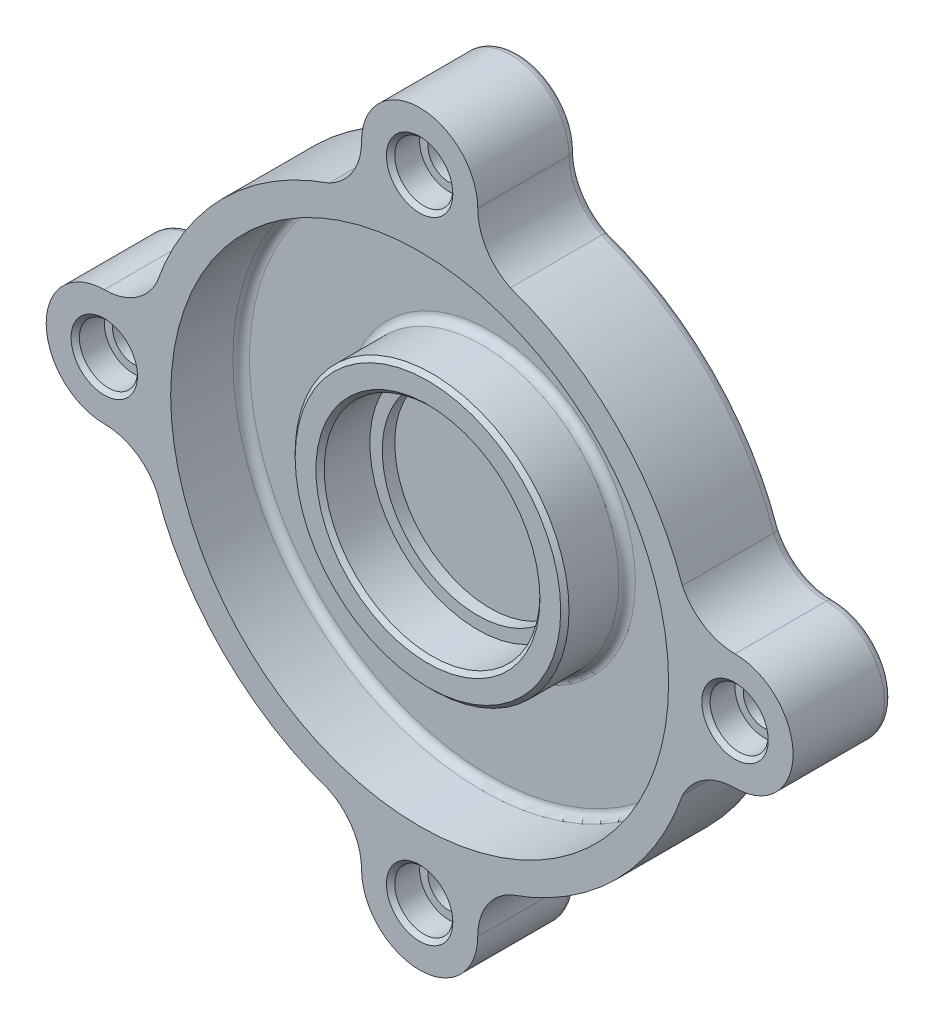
from build123d import *
from OCP.BRepFilletAPI import BRepFilletAPI_MakeChamfer

# Parameters (mm, degrees)
SKICA1_R                 = 67
P_IDAT_VYSUNUT_M1_DEPTH  = 24
SKICA2_R                 = 60
ODEBRAT_VYSUNUT_M1_DEPTH = 17
P_IDAT_START             = -24
P_IDAT_VYSUNUT_M2_DEPTH  = 24
SKICA4_R                 = 5
ODEBRAT_VYSUNUT_M2_DEPTH = 24
SKICA7_R                 = 7
SKICA7_R_2               = 5
ODEBRAT_VYSUNUT_M3_DEPTH = 7
ODEBRAT_START            = -7
SKICA8_R                 = 8
SKICA8_R_2               = 5
ODEBRAT_VYSUNUT_M4_DEPTH = 7
SKICA5_R                 = 33
SKICA5_R_2               = 26
P_IDAT_VYSUNUT_M3_DEPTH  = 15
SKICA6_R                 = 26
SKICA6_R_2               = 23
P_IDAT_VYSUNUT_M4_DEPTH  = 3
ZAOBLIT1_R               = 2
ZKOSEN_2_SIZE            = 1
ZKOSEN_3_SIZE            = 1
ZKOSEN_3_SIZE2           = 1.732050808


with BuildPart() as part:
    # Skica1 → P_idat vysunut_m1 (new body)
    with BuildSketch(Plane.XY):
        Circle(SKICA1_R)
    extrude(amount=P_IDAT_VYSUNUT_M1_DEPTH)

    # Skica2 → Odebrat vysunut_m1 (cut)
    with BuildSketch(Plane.XY.offset(24)):
        Circle(SKICA2_R)
    extrude(amount=-ODEBRAT_VYSUNUT_M1_DEPTH, mode=Mode.SUBTRACT)

    # Skica3 → P_idat vysunut_m2 (add)
    with BuildSketch(Plane.XY.offset(24).offset(P_IDAT_START)):
        with BuildLine():
            ThreePointArc((-21.879208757, 63.326931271), (0, 67), (21.879208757, 63.326931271))
            ThreePointArc((21.879208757, 63.326931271), (16.131994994, 68.491434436), (13.999760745, 75.918152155))
            ThreePointArc((13.999760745, 75.918152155), (0, 90), (-13.999760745, 75.918152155))
            ThreePointArc((-13.999760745, 75.918152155), (-16.131994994, 68.491434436), (-21.879208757, 63.326931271))
        make_face()
        with BuildLine():
            ThreePointArc((63.326931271, 21.879208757), (67, 0), (63.326931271, -21.879208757))
            ThreePointArc((63.326931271, -21.879208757), (68.491434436, -16.131994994), (75.918152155, -13.999760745))
            ThreePointArc((75.918152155, -13.999760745), (89.999940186, -0.040924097), (76, 14))
            ThreePointArc((76, 14), (68.526157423, 16.11033629), (63.326931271, 21.879208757))
        make_face()
        with BuildLine():
            ThreePointArc((21.879208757, -63.326931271), (0, -67), (-21.879208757, -63.326931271))
            ThreePointArc((-21.879208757, -63.326931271), (-16.131994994, -68.491434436), (-13.999760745, -75.918152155))
            ThreePointArc((-13.999760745, -75.918152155), (-0.040924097, -89.999940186), (14, -76))
            ThreePointArc((14, -76), (16.11033629, -68.526157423), (21.879208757, -63.326931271))
        make_face()
        with BuildLine():
            ThreePointArc((-63.326931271, -21.879208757), (-67, 0), (-63.326931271, 21.879208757))
            ThreePointArc((-63.326931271, 21.879208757), (-68.491434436, 16.131994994), (-75.918152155, 13.999760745))
            ThreePointArc((-75.918152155, 13.999760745), (-89.999940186, 0.040924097), (-76, -14))
            ThreePointArc((-76, -14), (-68.526157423, -16.11033629), (-63.326931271, -21.879208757))
        make_face()
    extrude(amount=P_IDAT_VYSUNUT_M2_DEPTH)

    # Skica4 → Odebrat vysunut_m2 (cut)
    with BuildSketch(Plane.XY.offset(24)):
        with Locations((0, 76)):
            Circle(SKICA4_R)
        with Locations((76, 0)):
            Circle(SKICA4_R)
        with Locations((0, -76)):
            Circle(SKICA4_R)
        with Locations((-76, 0)):
            Circle(SKICA4_R)
    extrude(amount=-ODEBRAT_VYSUNUT_M2_DEPTH, mode=Mode.SUBTRACT)

    # Skica7 → Odebrat vysunut_m3 (cut)
    # profile 1 of 4: a face of its own
    with BuildSketch(Plane.XY.offset(24)):
        with Locations((0, 76)):
            Circle(SKICA7_R)
        with Locations((0, 76)):
            Circle(SKICA7_R_2, mode=Mode.SUBTRACT)
    # profile 2 of 4: a face of its own
    with BuildSketch(Plane.XY.offset(24)):
        with Locations((76, 0)):
            Circle(SKICA7_R)
        with Locations((76, 0)):
            Circle(SKICA7_R_2, mode=Mode.SUBTRACT)
    # profile 3 of 4: a face of its own
    with BuildSketch(Plane.XY.offset(24)):
        with Locations((0, -76)):
            Circle(SKICA7_R)
        with Locations((0, -76)):
            Circle(SKICA7_R_2, mode=Mode.SUBTRACT)
    # profile 4 of 4: a face of its own
    with BuildSketch(Plane.XY.offset(24)):
        with Locations((-76, 0)):
            Circle(SKICA7_R)
        with Locations((-76, 0)):
            Circle(SKICA7_R_2, mode=Mode.SUBTRACT)
    extrude(amount=-ODEBRAT_VYSUNUT_M3_DEPTH, mode=Mode.SUBTRACT)

    # Skica8 → Odebrat vysunut_m4 (cut)
    # profile 1 of 4: a face of its own
    with BuildSketch(Plane(origin=(0, 0, 0), x_dir=(-1, 0, 0), z_dir=(0, 0, -1)).offset(ODEBRAT_START)):
        with Locations((0, 76)):
            Circle(SKICA8_R)
        with Locations(Location((0, 76, 0), (0, 0, 180))):
            Circle(SKICA8_R_2, mode=Mode.SUBTRACT)
    # profile 2 of 4: a face of its own
    with BuildSketch(Plane(origin=(0, 0, 0), x_dir=(-1, 0, 0), z_dir=(0, 0, -1)).offset(ODEBRAT_START)):
        with Locations((76, 0)):
            Circle(SKICA8_R)
        with Locations(Location((76, 0, 0), (0, 0, 180))):
            Circle(SKICA8_R_2, mode=Mode.SUBTRACT)
    # profile 3 of 4: a face of its own
    with BuildSketch(Plane(origin=(0, 0, 0), x_dir=(-1, 0, 0), z_dir=(0, 0, -1)).offset(ODEBRAT_START)):
        with Locations((0, -76)):
            Circle(SKICA8_R)
        with Locations(Location((0, -76, 0), (0, 0, 180))):
            Circle(SKICA8_R_2, mode=Mode.SUBTRACT)
    # profile 4 of 4: a face of its own
    with BuildSketch(Plane(origin=(0, 0, 0), x_dir=(-1, 0, 0), z_dir=(0, 0, -1)).offset(ODEBRAT_START)):
        with Locations((-76, 0)):
            Circle(SKICA8_R)
        with Locations(Location((-76, 0, 0), (0, 0, 180))):
            Circle(SKICA8_R_2, mode=Mode.SUBTRACT)
    extrude(amount=ODEBRAT_VYSUNUT_M4_DEPTH, mode=Mode.SUBTRACT)

    # Skica5 → P_idat vysunut_m3 (add)
    with BuildSketch(Plane.XY.offset(7)):
        Circle(SKICA5_R)
        Circle(SKICA5_R_2, mode=Mode.SUBTRACT)
    extrude(amount=P_IDAT_VYSUNUT_M3_DEPTH)

    # Skica6 → P_idat vysunut_m4 (add)
    with BuildSketch(Plane.XY.offset(7)):
        Circle(SKICA6_R)
        Circle(SKICA6_R_2, mode=Mode.SUBTRACT)
    extrude(amount=P_IDAT_VYSUNUT_M4_DEPTH)

    # Zaoblit1
    zaoblit1_edges = [part.edges().sort_by_distance(p)[0] for p in [
        (-47.376154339, -47.376154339, 0),
        (-89.999940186, 0.040924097, 0),
        (-68.491434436, 16.131994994, 0),
        (-68.526157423, -16.11033629, 0),
        (-33, 0, 7),
        (-47.376154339, 47.376154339, 0),
        (0, 90, 0),
        (16.131994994, 68.491434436, 0),
        (-16.131994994, 68.491434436, 0),
        (47.376154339, 47.376154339, 0),
        (89.999940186, -0.040924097, 0),
        (68.491434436, -16.131994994, 0),
        (68.526157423, 16.11033629, 0),
        (47.376154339, -47.376154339, 0),
        (-16.131994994, -68.491434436, 0),
        (-0.040924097, -89.999940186, 0),
        (16.11033629, -68.526157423, 0),
        (-60, 0, 7),
    ]]
    fillet(zaoblit1_edges, radius=ZAOBLIT1_R)

    # Zkosen_2
    zkosen_2_edges = [part.edges().sort_by_distance(p)[0] for p in [
        (-83, 0, 24),
        (8, 76, 0),
        (-68, 0, 0),
        (8, -76, 0),
        (84, 0, 0),
        (-33, 0, 22),
        (-26, 0, 22),
        (-7, 76, 24),
        (69, 0, 24),
        (-7, -76, 24),
    ]]
    chamfer(zkosen_2_edges, length=ZKOSEN_2_SIZE)

    # Zkosen_3: one chamfer whose edges measure the first distance from different faces: ONE call of the kernel's chamfer builder (chamfer() names one face for all edges)
    zkosen_3_edges_1 = [part.edges().sort_by_distance(p)[0] for p in [
        (-5, 76, 7),
    ]]
    zkosen_3_side_1 = [part.faces().sort_by_distance(p)[0] for p in [
        (7.77372583, 76, 7),
    ]]
    zkosen_3_edges_2 = [part.edges().sort_by_distance(p)[0] for p in [
        (-81, 0, 7),
    ]]
    zkosen_3_side_2 = [part.faces().sort_by_distance(p)[0] for p in [
        (-68.22627417, 0, 7),
    ]]
    zkosen_3_edges_3 = [part.edges().sort_by_distance(p)[0] for p in [
        (-5, -76, 7),
    ]]
    zkosen_3_side_3 = [part.faces().sort_by_distance(p)[0] for p in [
        (7.77372583, -76, 7),
    ]]
    zkosen_3_edges_4 = [part.edges().sort_by_distance(p)[0] for p in [
        (71, 0, 7),
    ]]
    zkosen_3_side_4 = [part.faces().sort_by_distance(p)[0] for p in [
        (83.77372583, 0, 7),
    ]]
    zkosen_3 = BRepFilletAPI_MakeChamfer(part.part.solid().wrapped)
    for e in zkosen_3_edges_1:
        zkosen_3.Add(ZKOSEN_3_SIZE, ZKOSEN_3_SIZE2, e.wrapped, zkosen_3_side_1[0].wrapped)  # the first distance lies on this face
    for e in zkosen_3_edges_2:
        zkosen_3.Add(ZKOSEN_3_SIZE, ZKOSEN_3_SIZE2, e.wrapped, zkosen_3_side_2[0].wrapped)  # the first distance lies on this face
    for e in zkosen_3_edges_3:
        zkosen_3.Add(ZKOSEN_3_SIZE, ZKOSEN_3_SIZE2, e.wrapped, zkosen_3_side_3[0].wrapped)  # the first distance lies on this face
    for e in zkosen_3_edges_4:
        zkosen_3.Add(ZKOSEN_3_SIZE, ZKOSEN_3_SIZE2, e.wrapped, zkosen_3_side_4[0].wrapped)  # the first distance lies on this face
    add(Compound.cast(zkosen_3.Shape()), mode=Mode.REPLACE)


solid = part.part
